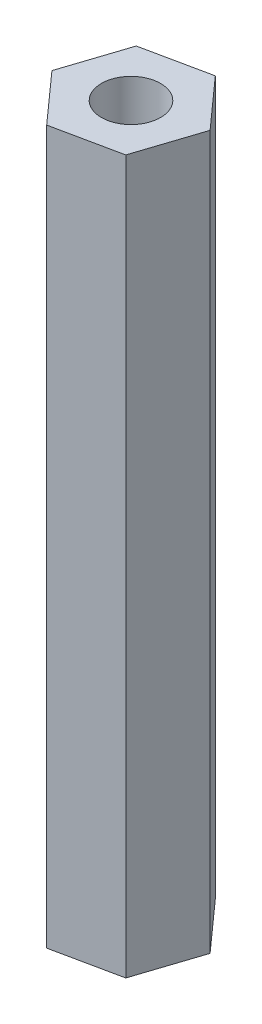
ISO-10303-21;
HEADER;
FILE_DESCRIPTION(('STEP AP214'),'2;1');
FILE_NAME('part.step','',(''),(''),'','','');
FILE_SCHEMA(('AUTOMOTIVE_DESIGN { 1 0 10303 214 1 1 1 1 }'));
ENDSEC;
DATA;
#1=APPLICATION_CONTEXT('core data for automotive mechanical design processes');
#2=APPLICATION_PROTOCOL_DEFINITION('international standard','automotive_design',2000,#1);
#3=PRODUCT_CONTEXT('',#1,'mechanical');
#4=PRODUCT('Part','Part','',(#3));
#5=PRODUCT_RELATED_PRODUCT_CATEGORY('part','',(#4));
#6=PRODUCT_DEFINITION_FORMATION('','',#4);
#7=PRODUCT_DEFINITION_CONTEXT('part definition',#1,'design');
#8=PRODUCT_DEFINITION('design','',#6,#7);
#9=PRODUCT_DEFINITION_SHAPE('','',#8);
#10=(LENGTH_UNIT() NAMED_UNIT(*) SI_UNIT(.MILLI.,.METRE.));
#11=(NAMED_UNIT(*) PLANE_ANGLE_UNIT() SI_UNIT($,.RADIAN.));
#12=(NAMED_UNIT(*) SI_UNIT($,.STERADIAN.) SOLID_ANGLE_UNIT());
#13=UNCERTAINTY_MEASURE_WITH_UNIT(LENGTH_MEASURE(1.E-05),#10,'distance_accuracy_value','');
#14=(GEOMETRIC_REPRESENTATION_CONTEXT(3) GLOBAL_UNCERTAINTY_ASSIGNED_CONTEXT((#13)) GLOBAL_UNIT_ASSIGNED_CONTEXT((#10,
#11,#12)) REPRESENTATION_CONTEXT('',''));
#15=CARTESIAN_POINT('',(0.,0.,0.));
#16=DIRECTION('',(0.,0.,1.));
#17=DIRECTION('',(1.,0.,0.));
#18=AXIS2_PLACEMENT_3D('',#15,#16,#17);
#19=CARTESIAN_POINT('',(0.,40.,0.));
#20=DIRECTION('',(0.,1.,0.));
#21=DIRECTION('',(0.,0.,1.));
#22=AXIS2_PLACEMENT_3D('',#19,#20,#21);
#23=PLANE('',#22);
#24=DIRECTION('',(0.666829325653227,0.,0.745210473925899));
#25=VECTOR('',#24,1.);
#26=CARTESIAN_POINT('',(-3.66955166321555,40.,0.76813470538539));
#27=LINE('',#26,#25);
#28=CARTESIAN_POINT('',(-3.66955166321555,40.,0.76813470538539));
#29=VERTEX_POINT('',#28);
#30=CARTESIAN_POINT('',(-1.16955166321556,40.,3.5619923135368));
#31=VERTEX_POINT('',#30);
#32=EDGE_CURVE('E129',#29,#31,#27,.T.);
#33=ORIENTED_EDGE('',*,*,#32,.T.);
#34=DIRECTION('',(0.978785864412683,0.,-0.204885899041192));
#35=VECTOR('',#34,1.);
#36=CARTESIAN_POINT('',(-1.16955166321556,40.,3.5619923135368));
#37=LINE('',#36,#35);
#38=CARTESIAN_POINT('',(2.5,40.,2.79385760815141));
#39=VERTEX_POINT('',#38);
#40=EDGE_CURVE('E87',#31,#39,#37,.T.);
#41=ORIENTED_EDGE('',*,*,#40,.T.);
#42=DIRECTION('',(0.311956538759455,0.,-0.95009637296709));
#43=VECTOR('',#42,1.);
#44=CARTESIAN_POINT('',(2.5,40.,2.79385760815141));
#45=LINE('',#44,#43);
#46=CARTESIAN_POINT('',(3.66955166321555,40.,-0.768134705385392));
#47=VERTEX_POINT('',#46);
#48=EDGE_CURVE('E100',#39,#47,#45,.T.);
#49=ORIENTED_EDGE('',*,*,#48,.T.);
#50=DIRECTION('',(-0.666829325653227,0.,-0.745210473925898));
#51=VECTOR('',#50,1.);
#52=CARTESIAN_POINT('',(3.66955166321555,40.,-0.768134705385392));
#53=LINE('',#52,#51);
#54=CARTESIAN_POINT('',(1.16955166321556,40.,-3.5619923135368));
#55=VERTEX_POINT('',#54);
#56=EDGE_CURVE('E94',#47,#55,#53,.T.);
#57=ORIENTED_EDGE('',*,*,#56,.T.);
#58=DIRECTION('',(-0.978785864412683,0.,0.204885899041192));
#59=VECTOR('',#58,1.);
#60=CARTESIAN_POINT('',(1.16955166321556,40.,-3.5619923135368));
#61=LINE('',#60,#59);
#62=CARTESIAN_POINT('',(-2.5,40.,-2.79385760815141));
#63=VERTEX_POINT('',#62);
#64=EDGE_CURVE('E98',#55,#63,#61,.T.);
#65=ORIENTED_EDGE('',*,*,#64,.T.);
#66=DIRECTION('',(-0.311956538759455,0.,0.95009637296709));
#67=VECTOR('',#66,1.);
#68=CARTESIAN_POINT('',(-2.5,40.,-2.79385760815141));
#69=LINE('',#68,#67);
#70=EDGE_CURVE('E50',#63,#29,#69,.T.);
#71=ORIENTED_EDGE('',*,*,#70,.T.);
#72=EDGE_LOOP('',(#33,#41,#49,#57,#65,#71));
#73=FACE_BOUND('',#72,.T.);
#74=CARTESIAN_POINT('',(0.,40.,0.));
#75=DIRECTION('',(0.,1.,0.));
#76=DIRECTION('',(0.,0.,1.));
#77=AXIS2_PLACEMENT_3D('',#74,#75,#76);
#78=CIRCLE('',#77,1.66);
#79=CARTESIAN_POINT('',(0.,40.,1.66));
#80=VERTEX_POINT('',#79);
#81=EDGE_CURVE('E122',#80,#80,#78,.T.);
#82=ORIENTED_EDGE('',*,*,#81,.F.);
#83=EDGE_LOOP('',(#82));
#84=FACE_BOUND('',#83,.T.);
#85=ADVANCED_FACE('F33',(#73,#84),#23,.T.);
#86=CARTESIAN_POINT('',(0.,0.,0.));
#87=DIRECTION('',(0.,1.,0.));
#88=DIRECTION('',(0.,0.,1.));
#89=AXIS2_PLACEMENT_3D('',#86,#87,#88);
#90=PLANE('',#89);
#91=DIRECTION('',(0.666829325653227,0.,0.745210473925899));
#92=VECTOR('',#91,1.);
#93=CARTESIAN_POINT('',(-3.66955166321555,0.,0.76813470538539));
#94=LINE('',#93,#92);
#95=CARTESIAN_POINT('',(-3.66955166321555,0.,0.76813470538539));
#96=VERTEX_POINT('',#95);
#97=CARTESIAN_POINT('',(-1.16955166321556,0.,3.5619923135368));
#98=VERTEX_POINT('',#97);
#99=EDGE_CURVE('E118',#96,#98,#94,.T.);
#100=ORIENTED_EDGE('',*,*,#99,.F.);
#101=DIRECTION('',(-0.311956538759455,0.,0.95009637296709));
#102=VECTOR('',#101,1.);
#103=CARTESIAN_POINT('',(-2.5,0.,-2.79385760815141));
#104=LINE('',#103,#102);
#105=CARTESIAN_POINT('',(-2.5,0.,-2.79385760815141));
#106=VERTEX_POINT('',#105);
#107=EDGE_CURVE('E79',#106,#96,#104,.T.);
#108=ORIENTED_EDGE('',*,*,#107,.F.);
#109=DIRECTION('',(-0.978785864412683,0.,0.204885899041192));
#110=VECTOR('',#109,1.);
#111=CARTESIAN_POINT('',(1.16955166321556,0.,-3.5619923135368));
#112=LINE('',#111,#110);
#113=CARTESIAN_POINT('',(1.16955166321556,0.,-3.5619923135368));
#114=VERTEX_POINT('',#113);
#115=EDGE_CURVE('E73',#114,#106,#112,.T.);
#116=ORIENTED_EDGE('',*,*,#115,.F.);
#117=DIRECTION('',(-0.666829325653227,0.,-0.745210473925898));
#118=VECTOR('',#117,1.);
#119=CARTESIAN_POINT('',(3.66955166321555,0.,-0.768134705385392));
#120=LINE('',#119,#118);
#121=CARTESIAN_POINT('',(3.66955166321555,0.,-0.768134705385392));
#122=VERTEX_POINT('',#121);
#123=EDGE_CURVE('E108',#122,#114,#120,.T.);
#124=ORIENTED_EDGE('',*,*,#123,.F.);
#125=DIRECTION('',(0.311956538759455,0.,-0.95009637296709));
#126=VECTOR('',#125,1.);
#127=CARTESIAN_POINT('',(2.5,0.,2.79385760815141));
#128=LINE('',#127,#126);
#129=CARTESIAN_POINT('',(2.5,0.,2.79385760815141));
#130=VERTEX_POINT('',#129);
#131=EDGE_CURVE('E124',#130,#122,#128,.T.);
#132=ORIENTED_EDGE('',*,*,#131,.F.);
#133=DIRECTION('',(0.978785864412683,0.,-0.204885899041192));
#134=VECTOR('',#133,1.);
#135=CARTESIAN_POINT('',(-1.16955166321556,0.,3.5619923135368));
#136=LINE('',#135,#134);
#137=EDGE_CURVE('E121',#98,#130,#136,.T.);
#138=ORIENTED_EDGE('',*,*,#137,.F.);
#139=EDGE_LOOP('',(#100,#108,#116,#124,#132,#138));
#140=FACE_BOUND('',#139,.T.);
#141=CARTESIAN_POINT('',(0.,0.,0.));
#142=DIRECTION('',(0.,1.,0.));
#143=DIRECTION('',(0.,0.,1.));
#144=AXIS2_PLACEMENT_3D('',#141,#142,#143);
#145=CIRCLE('',#144,1.66);
#146=CARTESIAN_POINT('',(0.,0.,1.66));
#147=VERTEX_POINT('',#146);
#148=EDGE_CURVE('E222',#147,#147,#145,.T.);
#149=ORIENTED_EDGE('',*,*,#148,.T.);
#150=EDGE_LOOP('',(#149));
#151=FACE_BOUND('',#150,.T.);
#152=ADVANCED_FACE('F138',(#140,#151),#90,.F.);
#153=CARTESIAN_POINT('',(-3.66955166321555,40.,0.76813470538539));
#154=DIRECTION('',(0.745210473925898,0.,-0.666829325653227));
#155=DIRECTION('',(-0.666829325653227,0.,-0.745210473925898));
#156=AXIS2_PLACEMENT_3D('',#153,#154,#155);
#157=PLANE('',#156);
#158=ORIENTED_EDGE('',*,*,#99,.T.);
#159=DIRECTION('',(0.,-1.,0.));
#160=VECTOR('',#159,1.);
#161=CARTESIAN_POINT('',(-1.16955166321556,40.,3.5619923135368));
#162=LINE('',#161,#160);
#163=EDGE_CURVE('E11',#31,#98,#162,.T.);
#164=ORIENTED_EDGE('',*,*,#163,.F.);
#165=ORIENTED_EDGE('',*,*,#32,.F.);
#166=DIRECTION('',(0.,-1.,0.));
#167=VECTOR('',#166,1.);
#168=CARTESIAN_POINT('',(-3.66955166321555,40.,0.76813470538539));
#169=LINE('',#168,#167);
#170=EDGE_CURVE('E114',#29,#96,#169,.T.);
#171=ORIENTED_EDGE('',*,*,#170,.T.);
#172=EDGE_LOOP('',(#158,#164,#165,#171));
#173=FACE_BOUND('',#172,.T.);
#174=ADVANCED_FACE('F35',(#173),#157,.F.);
#175=CARTESIAN_POINT('',(-1.16955166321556,40.,3.5619923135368));
#176=DIRECTION('',(-0.204885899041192,0.,-0.978785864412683));
#177=DIRECTION('',(-0.978785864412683,0.,0.204885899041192));
#178=AXIS2_PLACEMENT_3D('',#175,#176,#177);
#179=PLANE('',#178);
#180=ORIENTED_EDGE('',*,*,#137,.T.);
#181=DIRECTION('',(0.,-1.,0.));
#182=VECTOR('',#181,1.);
#183=CARTESIAN_POINT('',(2.5,40.,2.79385760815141));
#184=LINE('',#183,#182);
#185=EDGE_CURVE('E42',#39,#130,#184,.T.);
#186=ORIENTED_EDGE('',*,*,#185,.F.);
#187=ORIENTED_EDGE('',*,*,#40,.F.);
#188=ORIENTED_EDGE('',*,*,#163,.T.);
#189=EDGE_LOOP('',(#180,#186,#187,#188));
#190=FACE_BOUND('',#189,.T.);
#191=ADVANCED_FACE('F163',(#190),#179,.F.);
#192=CARTESIAN_POINT('',(2.5,40.,2.79385760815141));
#193=DIRECTION('',(-0.95009637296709,0.,-0.311956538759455));
#194=DIRECTION('',(-0.311956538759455,0.,0.95009637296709));
#195=AXIS2_PLACEMENT_3D('',#192,#193,#194);
#196=PLANE('',#195);
#197=ORIENTED_EDGE('',*,*,#131,.T.);
#198=DIRECTION('',(0.,-1.,0.));
#199=VECTOR('',#198,1.);
#200=CARTESIAN_POINT('',(3.66955166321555,40.,-0.768134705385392));
#201=LINE('',#200,#199);
#202=EDGE_CURVE('E109',#47,#122,#201,.T.);
#203=ORIENTED_EDGE('',*,*,#202,.F.);
#204=ORIENTED_EDGE('',*,*,#48,.F.);
#205=ORIENTED_EDGE('',*,*,#185,.T.);
#206=EDGE_LOOP('',(#197,#203,#204,#205));
#207=FACE_BOUND('',#206,.T.);
#208=ADVANCED_FACE('F135',(#207),#196,.F.);
#209=CARTESIAN_POINT('',(3.66955166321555,40.,-0.768134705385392));
#210=DIRECTION('',(-0.745210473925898,0.,0.666829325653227));
#211=DIRECTION('',(0.666829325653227,0.,0.745210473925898));
#212=AXIS2_PLACEMENT_3D('',#209,#210,#211);
#213=PLANE('',#212);
#214=ORIENTED_EDGE('',*,*,#123,.T.);
#215=DIRECTION('',(0.,-1.,0.));
#216=VECTOR('',#215,1.);
#217=CARTESIAN_POINT('',(1.16955166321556,40.,-3.5619923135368));
#218=LINE('',#217,#216);
#219=EDGE_CURVE('E105',#55,#114,#218,.T.);
#220=ORIENTED_EDGE('',*,*,#219,.F.);
#221=ORIENTED_EDGE('',*,*,#56,.F.);
#222=ORIENTED_EDGE('',*,*,#202,.T.);
#223=EDGE_LOOP('',(#214,#220,#221,#222));
#224=FACE_BOUND('',#223,.T.);
#225=ADVANCED_FACE('F106',(#224),#213,.F.);
#226=CARTESIAN_POINT('',(1.16955166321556,40.,-3.5619923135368));
#227=DIRECTION('',(0.204885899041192,0.,0.978785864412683));
#228=DIRECTION('',(0.978785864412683,0.,-0.204885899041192));
#229=AXIS2_PLACEMENT_3D('',#226,#227,#228);
#230=PLANE('',#229);
#231=ORIENTED_EDGE('',*,*,#115,.T.);
#232=DIRECTION('',(0.,-1.,0.));
#233=VECTOR('',#232,1.);
#234=CARTESIAN_POINT('',(-2.5,40.,-2.79385760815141));
#235=LINE('',#234,#233);
#236=EDGE_CURVE('E110',#63,#106,#235,.T.);
#237=ORIENTED_EDGE('',*,*,#236,.F.);
#238=ORIENTED_EDGE('',*,*,#64,.F.);
#239=ORIENTED_EDGE('',*,*,#219,.T.);
#240=EDGE_LOOP('',(#231,#237,#238,#239));
#241=FACE_BOUND('',#240,.T.);
#242=ADVANCED_FACE('F112',(#241),#230,.F.);
#243=CARTESIAN_POINT('',(-2.5,40.,-2.79385760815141));
#244=DIRECTION('',(0.95009637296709,0.,0.311956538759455));
#245=DIRECTION('',(0.311956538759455,0.,-0.95009637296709));
#246=AXIS2_PLACEMENT_3D('',#243,#244,#245);
#247=PLANE('',#246);
#248=ORIENTED_EDGE('',*,*,#107,.T.);
#249=ORIENTED_EDGE('',*,*,#170,.F.);
#250=ORIENTED_EDGE('',*,*,#70,.F.);
#251=ORIENTED_EDGE('',*,*,#236,.T.);
#252=EDGE_LOOP('',(#248,#249,#250,#251));
#253=FACE_BOUND('',#252,.T.);
#254=ADVANCED_FACE('F143',(#253),#247,.F.);
#255=CARTESIAN_POINT('',(0.,40.,0.));
#256=DIRECTION('',(0.,-1.,0.));
#257=DIRECTION('',(0.,0.,-1.));
#258=AXIS2_PLACEMENT_3D('',#255,#256,#257);
#259=CYLINDRICAL_SURFACE('',#258,1.66);
#260=ORIENTED_EDGE('',*,*,#81,.T.);
#261=EDGE_LOOP('',(#260));
#262=FACE_BOUND('',#261,.T.);
#263=ORIENTED_EDGE('',*,*,#148,.F.);
#264=EDGE_LOOP('',(#263));
#265=FACE_BOUND('',#264,.T.);
#266=ADVANCED_FACE('F145',(#262,#265),#259,.F.);
#267=CLOSED_SHELL('',(#85,#152,#174,#191,#208,#225,#242,#254,#266));
#268=MANIFOLD_SOLID_BREP('B2',#267);
#269=ADVANCED_BREP_SHAPE_REPRESENTATION('',(#18,#268),#14);
#270=SHAPE_DEFINITION_REPRESENTATION(#9,#269);
ENDSEC;
END-ISO-10303-21;
